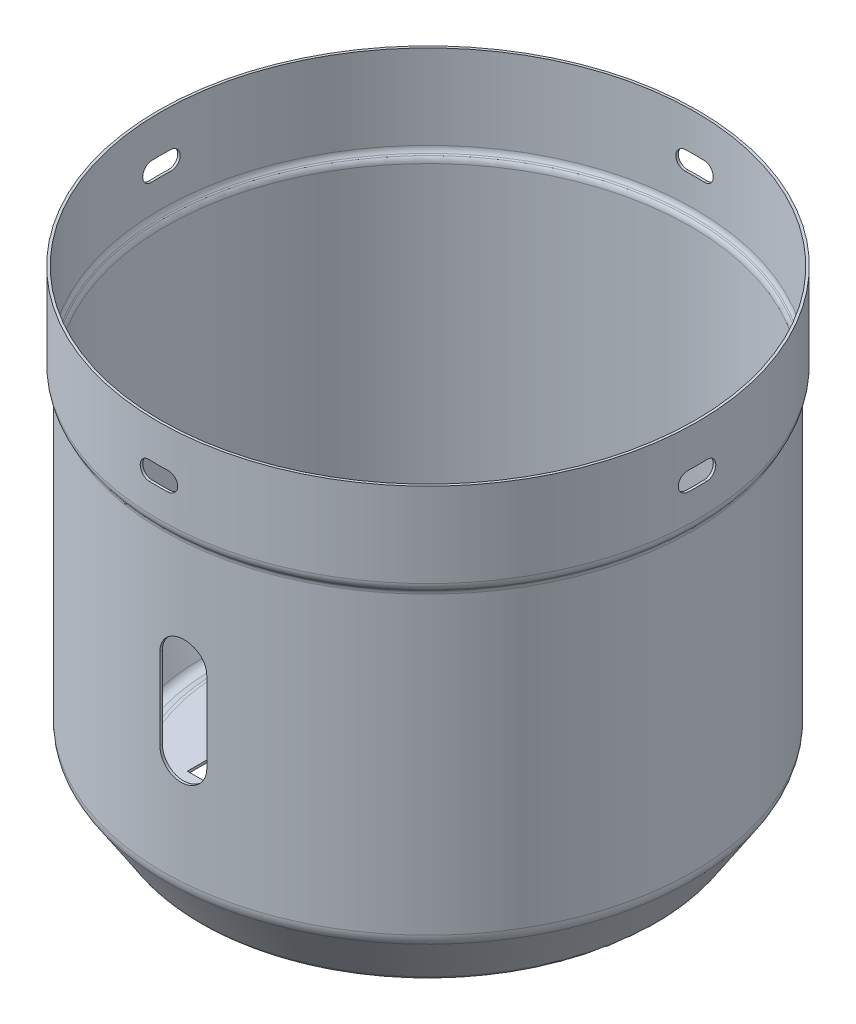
from build123d import *

# Parameters (mm, degrees)
SKETCH_2_R               = 3.5
SKETCH_2_W               = 7
SKETCH_2_H               = 7
CUT_EXTRUDE_1_DEPTH      = 10
CUT_EXTRUDE_START        = -85
CUT_EXTRUDE_2_DEPTH      = 10
PATTERN_CIRCULAR_1_COUNT = 4
CUT_EXTRUDE_START_2      = 86
CUT_EXTRUDE_3_DEPTH      = 10


with BuildPart() as part:
    # Sketch 1 → Revolve 1 (revolve)
    with BuildSketch(Plane.XY, mode=Mode.PRIVATE) as revolve_1_sk:
        with BuildLine():
            Line((0, 2), (65.422252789, 2))
            ThreePointArc((65.422252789, 2), (65.989575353, 1.94586916), (66.536424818, 1.785430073))
            Line((66.536424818, 1.785430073), (68.71293602, 0.914825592))
            ThreePointArc((68.71293602, 0.914825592), (70.733586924, 0.840483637), (72.342438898, 2.065290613))
            Line((72.342438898, 2.065290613), (83.192218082, 18.757258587))
            ThreePointArc((83.192218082, 18.757258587), (83.793802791, 20.061125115), (84, 21.48220034))
            Line((84, 21.48220034), (84, 116))
            ThreePointArc((84, 116), (84.153950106, 116.948683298), (84.6, 117.8))
            Line((84.6, 117.8), (84.9, 118.2))
            ThreePointArc((84.9, 118.2), (85.346049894, 119.051316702), (85.5, 120))
            Line((85.5, 120), (85.5, 147))
            Line((85.5, 147), (86.3, 147))
            Line((86.3, 147), (86.3, 120))
            ThreePointArc((86.3, 120), (86.104996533, 118.798334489), (85.54, 117.72))
            Line((85.54, 117.72), (85.24, 117.32))
            ThreePointArc((85.24, 117.32), (84.912896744, 116.695701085), (84.8, 116))
            Line((84.8, 116), (84.8, 21.48220034))
            ThreePointArc((84.8, 21.48220034), (84.560811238, 19.833753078), (83.862972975, 18.321267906))
            Line((83.862972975, 18.321267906), (73.013193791, 1.629299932))
            ThreePointArc((73.013193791, 1.629299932), (70.975314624, 0.077877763), (68.415823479, 0.172044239))
            Line((68.415823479, 0.172044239), (66.239312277, 1.04264872))
            ThreePointArc((66.239312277, 1.04264872), (65.838289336, 1.160304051), (65.422252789, 1.2))
            Line((65.422252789, 1.2), (0, 1.2))
            Line((0, 1.2), (0, 2))
        make_face()
    revolve(revolve_1_sk.sketch.rotate(Axis((0, 0, 0), (0, 1, 0)), 90), axis=Axis((0, 0, 0), (0, 1, 0)))

    # Sketch 2 → Cut-Extrude 1 (cut)
    with BuildSketch(Plane.XZ.offset(-1.2)):
        with Locations(Location((0, 0, 0), (0, 0, 270))):
            Circle(SKETCH_2_R)
        with Locations((20, 0)):
            Rectangle(SKETCH_2_W, SKETCH_2_H)
        with Locations((10, 0)):
            Rectangle(SKETCH_2_W, SKETCH_2_H)
        with Locations((30, 0)):
            Rectangle(SKETCH_2_W, SKETCH_2_H)
        with Locations((40, 0)):
            Rectangle(SKETCH_2_W, SKETCH_2_H)
        with Locations((50, 0)):
            Rectangle(SKETCH_2_W, SKETCH_2_H)
        with Locations((20, 10)):
            Rectangle(SKETCH_2_W, SKETCH_2_H)
        with Locations((30, 10)):
            Rectangle(SKETCH_2_W, SKETCH_2_H)
        with Locations((40, 10)):
            Rectangle(SKETCH_2_W, SKETCH_2_H)
        with Locations((50, 10)):
            Rectangle(SKETCH_2_W, SKETCH_2_H)
        with Locations((20, 20)):
            Rectangle(SKETCH_2_W, SKETCH_2_H)
        with Locations((30, 20)):
            Rectangle(SKETCH_2_W, SKETCH_2_H)
        with Locations((40, 20)):
            Rectangle(SKETCH_2_W, SKETCH_2_H)
        with Locations((20, 30)):
            Rectangle(SKETCH_2_W, SKETCH_2_H)
        with Locations((30, 30)):
            Rectangle(SKETCH_2_W, SKETCH_2_H)
        with Locations((40, 30)):
            Rectangle(SKETCH_2_W, SKETCH_2_H)
        with Locations((20, 40)):
            Rectangle(SKETCH_2_W, SKETCH_2_H)
        with Locations((30, 40)):
            Rectangle(SKETCH_2_W, SKETCH_2_H)
        with Locations((10, 10)):
            Rectangle(SKETCH_2_W, SKETCH_2_H)
        with Locations((10, 20)):
            Rectangle(SKETCH_2_W, SKETCH_2_H)
        with Locations((10, 30)):
            Rectangle(SKETCH_2_W, SKETCH_2_H)
        with Locations((10, 40)):
            Rectangle(SKETCH_2_W, SKETCH_2_H)
        with Locations((10, 50)):
            Rectangle(SKETCH_2_W, SKETCH_2_H)
        with Locations((50, -10)):
            Rectangle(SKETCH_2_W, SKETCH_2_H)
        with Locations((40, -10)):
            Rectangle(SKETCH_2_W, SKETCH_2_H)
        with Locations((40, -20)):
            Rectangle(SKETCH_2_W, SKETCH_2_H)
        with Locations((40, -30)):
            Rectangle(SKETCH_2_W, SKETCH_2_H)
        with Locations((30, -10)):
            Rectangle(SKETCH_2_W, SKETCH_2_H)
        with Locations((30, -20)):
            Rectangle(SKETCH_2_W, SKETCH_2_H)
        with Locations((30, -30)):
            Rectangle(SKETCH_2_W, SKETCH_2_H)
        with Locations((30, -40)):
            Rectangle(SKETCH_2_W, SKETCH_2_H)
        with Locations((20, -10)):
            Rectangle(SKETCH_2_W, SKETCH_2_H)
        with Locations((20, -20)):
            Rectangle(SKETCH_2_W, SKETCH_2_H)
        with Locations((20, -30)):
            Rectangle(SKETCH_2_W, SKETCH_2_H)
        with Locations((20, -40)):
            Rectangle(SKETCH_2_W, SKETCH_2_H)
        with Locations((10, -10)):
            Rectangle(SKETCH_2_W, SKETCH_2_H)
        with Locations((10, -20)):
            Rectangle(SKETCH_2_W, SKETCH_2_H)
        with Locations((10, -30)):
            Rectangle(SKETCH_2_W, SKETCH_2_H)
        with Locations((10, -40)):
            Rectangle(SKETCH_2_W, SKETCH_2_H)
        with Locations((10, -50)):
            Rectangle(SKETCH_2_W, SKETCH_2_H)
        with Locations((0, -50)):
            Rectangle(SKETCH_2_W, SKETCH_2_H)
        with Locations((0, -40)):
            Rectangle(SKETCH_2_W, SKETCH_2_H)
        with Locations((0, -30)):
            Rectangle(SKETCH_2_W, SKETCH_2_H)
        with Locations((0, -20)):
            Rectangle(SKETCH_2_W, SKETCH_2_H)
        with Locations((0, -10)):
            Rectangle(SKETCH_2_W, SKETCH_2_H)
        with Locations((-10, -50)):
            Rectangle(SKETCH_2_W, SKETCH_2_H)
        with Locations((-10, -40)):
            Rectangle(SKETCH_2_W, SKETCH_2_H)
        with Locations((-20, -40)):
            Rectangle(SKETCH_2_W, SKETCH_2_H)
        with Locations((-30, -40)):
            Rectangle(SKETCH_2_W, SKETCH_2_H)
        with Locations((-10, -30)):
            Rectangle(SKETCH_2_W, SKETCH_2_H)
        with Locations((-20, -30)):
            Rectangle(SKETCH_2_W, SKETCH_2_H)
        with Locations((-30, -30)):
            Rectangle(SKETCH_2_W, SKETCH_2_H)
        with Locations((-40, -30)):
            Rectangle(SKETCH_2_W, SKETCH_2_H)
        with Locations((-10, -20)):
            Rectangle(SKETCH_2_W, SKETCH_2_H)
        with Locations((-20, -20)):
            Rectangle(SKETCH_2_W, SKETCH_2_H)
        with Locations((-30, -20)):
            Rectangle(SKETCH_2_W, SKETCH_2_H)
        with Locations((-40, -20)):
            Rectangle(SKETCH_2_W, SKETCH_2_H)
        with Locations((-10, -10)):
            Rectangle(SKETCH_2_W, SKETCH_2_H)
        with Locations((-20, -10)):
            Rectangle(SKETCH_2_W, SKETCH_2_H)
        with Locations((-30, -10)):
            Rectangle(SKETCH_2_W, SKETCH_2_H)
        with Locations((-40, -10)):
            Rectangle(SKETCH_2_W, SKETCH_2_H)
        with Locations((-50, -10)):
            Rectangle(SKETCH_2_W, SKETCH_2_H)
        with Locations((-50, 0)):
            Rectangle(SKETCH_2_W, SKETCH_2_H)
        with Locations((-40, 0)):
            Rectangle(SKETCH_2_W, SKETCH_2_H)
        with Locations((-30, 0)):
            Rectangle(SKETCH_2_W, SKETCH_2_H)
        with Locations((-20, 0)):
            Rectangle(SKETCH_2_W, SKETCH_2_H)
        with Locations((-10, 0)):
            Rectangle(SKETCH_2_W, SKETCH_2_H)
        with Locations((-50, 10)):
            Rectangle(SKETCH_2_W, SKETCH_2_H)
        with Locations((-40, 10)):
            Rectangle(SKETCH_2_W, SKETCH_2_H)
        with Locations((-40, 20)):
            Rectangle(SKETCH_2_W, SKETCH_2_H)
        with Locations((-40, 30)):
            Rectangle(SKETCH_2_W, SKETCH_2_H)
        with Locations((-30, 10)):
            Rectangle(SKETCH_2_W, SKETCH_2_H)
        with Locations((-30, 20)):
            Rectangle(SKETCH_2_W, SKETCH_2_H)
        with Locations((-30, 30)):
            Rectangle(SKETCH_2_W, SKETCH_2_H)
        with Locations((-30, 40)):
            Rectangle(SKETCH_2_W, SKETCH_2_H)
        with Locations((-20, 10)):
            Rectangle(SKETCH_2_W, SKETCH_2_H)
        with Locations((-20, 20)):
            Rectangle(SKETCH_2_W, SKETCH_2_H)
        with Locations((-20, 30)):
            Rectangle(SKETCH_2_W, SKETCH_2_H)
        with Locations((-20, 40)):
            Rectangle(SKETCH_2_W, SKETCH_2_H)
        with Locations((-10, 10)):
            Rectangle(SKETCH_2_W, SKETCH_2_H)
        with Locations((-10, 20)):
            Rectangle(SKETCH_2_W, SKETCH_2_H)
        with Locations((-10, 30)):
            Rectangle(SKETCH_2_W, SKETCH_2_H)
        with Locations((-10, 40)):
            Rectangle(SKETCH_2_W, SKETCH_2_H)
        with Locations((-10, 50)):
            Rectangle(SKETCH_2_W, SKETCH_2_H)
        with Locations((0, 50)):
            Rectangle(SKETCH_2_W, SKETCH_2_H)
        with Locations((0, 40)):
            Rectangle(SKETCH_2_W, SKETCH_2_H)
        with Locations((0, 30)):
            Rectangle(SKETCH_2_W, SKETCH_2_H)
        with Locations((0, 20)):
            Rectangle(SKETCH_2_W, SKETCH_2_H)
        with Locations((0, 10)):
            Rectangle(SKETCH_2_W, SKETCH_2_H)
    extrude(amount=-CUT_EXTRUDE_1_DEPTH, mode=Mode.SUBTRACT)

    # Sketch 3 → Cut-Extrude 2 (cut)
    with BuildSketch(Plane.XY.offset(CUT_EXTRUDE_START)):
        with BuildLine():
            Line((-3, 135), (3, 135))
            ThreePointArc((3, 135), (6, 132), (3, 129))
            Line((3, 129), (-3, 129))
            ThreePointArc((-3, 129), (-6, 132), (-3, 135))
        make_face()
    cut_extrude_2 = extrude(amount=-CUT_EXTRUDE_2_DEPTH, mode=Mode.SUBTRACT)

    # Pattern Circular 1: Cut-Extrude 2 ×4 about axis
    pattern_circular_1_axis = Axis((0, 0, 0), (0, -1, 0))
    for i in range(1, PATTERN_CIRCULAR_1_COUNT):
        add(cut_extrude_2.rotate(pattern_circular_1_axis, i * 360 / PATTERN_CIRCULAR_1_COUNT), mode=Mode.SUBTRACT)

    # Sketch 4 → Cut-Extrude 3 (cut)
    with BuildSketch(Plane.XY.offset(CUT_EXTRUDE_START_2)):
        with BuildLine():
            Line((13, 82), (13, 56))
            ThreePointArc((13, 56), (6, 49), (-1, 56))
            Line((-1, 56), (-1, 82))
            ThreePointArc((-1, 82), (6, 89), (13, 82))
        make_face()
    extrude(amount=-CUT_EXTRUDE_3_DEPTH, mode=Mode.SUBTRACT)


solid = part.part
